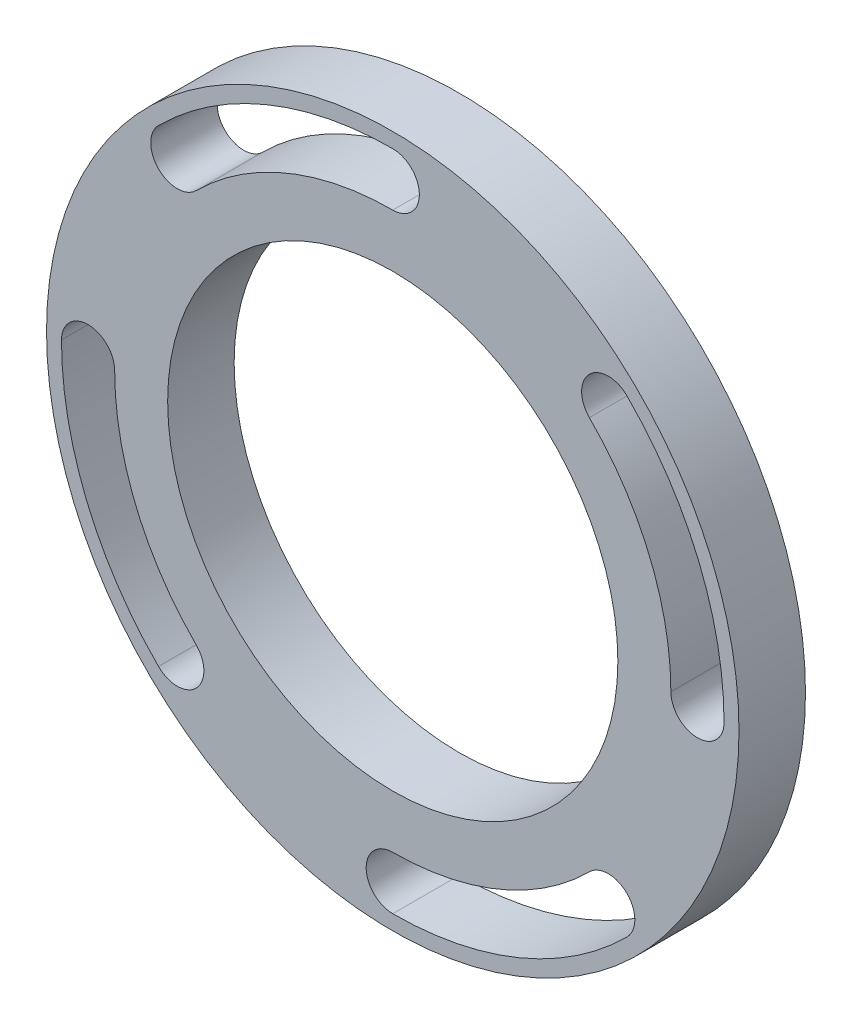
ISO-10303-21;
HEADER;
FILE_DESCRIPTION(('STEP AP214'),'2;1');
FILE_NAME('part.step','',(''),(''),'','','');
FILE_SCHEMA(('AUTOMOTIVE_DESIGN { 1 0 10303 214 1 1 1 1 }'));
ENDSEC;
DATA;
#1=APPLICATION_CONTEXT('core data for automotive mechanical design processes');
#2=APPLICATION_PROTOCOL_DEFINITION('international standard','automotive_design',2000,#1);
#3=PRODUCT_CONTEXT('',#1,'mechanical');
#4=PRODUCT('Part','Part','',(#3));
#5=PRODUCT_RELATED_PRODUCT_CATEGORY('part','',(#4));
#6=PRODUCT_DEFINITION_FORMATION('','',#4);
#7=PRODUCT_DEFINITION_CONTEXT('part definition',#1,'design');
#8=PRODUCT_DEFINITION('design','',#6,#7);
#9=PRODUCT_DEFINITION_SHAPE('','',#8);
#10=(LENGTH_UNIT() NAMED_UNIT(*) SI_UNIT(.MILLI.,.METRE.));
#11=(NAMED_UNIT(*) PLANE_ANGLE_UNIT() SI_UNIT($,.RADIAN.));
#12=(NAMED_UNIT(*) SI_UNIT($,.STERADIAN.) SOLID_ANGLE_UNIT());
#13=UNCERTAINTY_MEASURE_WITH_UNIT(LENGTH_MEASURE(1.E-05),#10,'distance_accuracy_value','');
#14=(GEOMETRIC_REPRESENTATION_CONTEXT(3) GLOBAL_UNCERTAINTY_ASSIGNED_CONTEXT((#13)) GLOBAL_UNIT_ASSIGNED_CONTEXT((#10,
#11,#12)) REPRESENTATION_CONTEXT('',''));
#15=CARTESIAN_POINT('',(0.,0.,0.));
#16=DIRECTION('',(0.,0.,1.));
#17=DIRECTION('',(1.,0.,0.));
#18=AXIS2_PLACEMENT_3D('',#15,#16,#17);
#19=CARTESIAN_POINT('',(0.,0.,-0.508000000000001));
#20=DIRECTION('',(0.,0.,-1.));
#21=DIRECTION('',(-1.,0.,0.));
#22=AXIS2_PLACEMENT_3D('',#19,#20,#21);
#23=PLANE('',#22);
#24=CARTESIAN_POINT('',(0.,0.,-0.508000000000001));
#25=DIRECTION('',(0.,0.,1.));
#26=DIRECTION('',(0.,1.,0.));
#27=AXIS2_PLACEMENT_3D('',#24,#25,#26);
#28=CIRCLE('',#27,19.1262);
#29=CARTESIAN_POINT('',(19.1262,1.97407768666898E-13,-0.508000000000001));
#30=VERTEX_POINT('',#29);
#31=CARTESIAN_POINT('',(13.5242657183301,13.5242657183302,-0.508000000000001));
#32=VERTEX_POINT('',#31);
#33=EDGE_CURVE('E156',#30,#32,#28,.T.);
#34=ORIENTED_EDGE('',*,*,#33,.T.);
#35=CARTESIAN_POINT('',(14.817422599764,14.8174225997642,-0.508000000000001));
#36=DIRECTION('',(0.,0.,-1.));
#37=DIRECTION('',(0.,1.,0.));
#38=AXIS2_PLACEMENT_3D('',#35,#36,#37);
#39=CIRCLE('',#38,1.8288);
#40=CARTESIAN_POINT('',(16.110579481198,16.1105794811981,-0.508000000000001));
#41=VERTEX_POINT('',#40);
#42=EDGE_CURVE('E150',#32,#41,#39,.T.);
#43=ORIENTED_EDGE('',*,*,#42,.T.);
#44=CARTESIAN_POINT('',(0.,0.,-0.508000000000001));
#45=DIRECTION('',(0.,0.,-1.));
#46=DIRECTION('',(0.,1.,0.));
#47=AXIS2_PLACEMENT_3D('',#44,#45,#46);
#48=CIRCLE('',#47,22.7838);
#49=CARTESIAN_POINT('',(22.7838,2.34983723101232E-13,-0.508000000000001));
#50=VERTEX_POINT('',#49);
#51=EDGE_CURVE('E159',#41,#50,#48,.T.);
#52=ORIENTED_EDGE('',*,*,#51,.T.);
#53=CARTESIAN_POINT('',(20.955,2.16899376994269E-13,-0.508000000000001));
#54=DIRECTION('',(0.,0.,-1.));
#55=DIRECTION('',(0.,1.,0.));
#56=AXIS2_PLACEMENT_3D('',#53,#54,#55);
#57=CIRCLE('',#56,1.8288);
#58=EDGE_CURVE('E50',#50,#30,#57,.T.);
#59=ORIENTED_EDGE('',*,*,#58,.T.);
#60=EDGE_LOOP('',(#34,#43,#52,#59));
#61=FACE_BOUND('',#60,.T.);
#62=CARTESIAN_POINT('',(0.,0.,-0.508000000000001));
#63=DIRECTION('',(0.,0.,1.));
#64=DIRECTION('',(1.,0.,0.));
#65=AXIS2_PLACEMENT_3D('',#62,#63,#64);
#66=CIRCLE('',#65,19.1262);
#67=CARTESIAN_POINT('',(0.,-19.1262,-0.508000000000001));
#68=VERTEX_POINT('',#67);
#69=CARTESIAN_POINT('',(13.5242657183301,-13.5242657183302,-0.508000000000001));
#70=VERTEX_POINT('',#69);
#71=EDGE_CURVE('E194',#68,#70,#66,.T.);
#72=ORIENTED_EDGE('',*,*,#71,.T.);
#73=CARTESIAN_POINT('',(14.817422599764,-14.8174225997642,-0.508000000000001));
#74=DIRECTION('',(0.,0.,-1.));
#75=DIRECTION('',(1.,0.,0.));
#76=AXIS2_PLACEMENT_3D('',#73,#74,#75);
#77=CIRCLE('',#76,1.8288);
#78=CARTESIAN_POINT('',(16.110579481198,-16.1105794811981,-0.508000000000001));
#79=VERTEX_POINT('',#78);
#80=EDGE_CURVE('E184',#70,#79,#77,.T.);
#81=ORIENTED_EDGE('',*,*,#80,.T.);
#82=CARTESIAN_POINT('',(0.,0.,-0.508000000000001));
#83=DIRECTION('',(0.,0.,-1.));
#84=DIRECTION('',(1.,0.,0.));
#85=AXIS2_PLACEMENT_3D('',#82,#83,#84);
#86=CIRCLE('',#85,22.7838);
#87=CARTESIAN_POINT('',(0.,-22.7838,-0.508000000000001));
#88=VERTEX_POINT('',#87);
#89=EDGE_CURVE('E187',#79,#88,#86,.T.);
#90=ORIENTED_EDGE('',*,*,#89,.T.);
#91=CARTESIAN_POINT('',(0.,-20.955,-0.508000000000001));
#92=DIRECTION('',(0.,0.,-1.));
#93=DIRECTION('',(1.,0.,0.));
#94=AXIS2_PLACEMENT_3D('',#91,#92,#93);
#95=CIRCLE('',#94,1.8288);
#96=EDGE_CURVE('E191',#88,#68,#95,.T.);
#97=ORIENTED_EDGE('',*,*,#96,.T.);
#98=EDGE_LOOP('',(#72,#81,#90,#97));
#99=FACE_BOUND('',#98,.T.);
#100=CARTESIAN_POINT('',(0.,0.,-0.508000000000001));
#101=DIRECTION('',(0.,0.,1.));
#102=DIRECTION('',(0.,-1.,0.));
#103=AXIS2_PLACEMENT_3D('',#100,#101,#102);
#104=CIRCLE('',#103,19.1262);
#105=CARTESIAN_POINT('',(-19.1262,0.,-0.508000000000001));
#106=VERTEX_POINT('',#105);
#107=CARTESIAN_POINT('',(-13.5242657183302,-13.5242657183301,-0.508000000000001));
#108=VERTEX_POINT('',#107);
#109=EDGE_CURVE('E226',#106,#108,#104,.T.);
#110=ORIENTED_EDGE('',*,*,#109,.T.);
#111=CARTESIAN_POINT('',(-14.8174225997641,-14.8174225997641,-0.508000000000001));
#112=DIRECTION('',(0.,0.,-1.));
#113=DIRECTION('',(0.,-1.,0.));
#114=AXIS2_PLACEMENT_3D('',#111,#112,#113);
#115=CIRCLE('',#114,1.8288);
#116=CARTESIAN_POINT('',(-16.1105794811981,-16.110579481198,-0.508000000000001));
#117=VERTEX_POINT('',#116);
#118=EDGE_CURVE('E216',#108,#117,#115,.T.);
#119=ORIENTED_EDGE('',*,*,#118,.T.);
#120=CARTESIAN_POINT('',(0.,0.,-0.508000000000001));
#121=DIRECTION('',(0.,0.,-1.));
#122=DIRECTION('',(0.,-1.,0.));
#123=AXIS2_PLACEMENT_3D('',#120,#121,#122);
#124=CIRCLE('',#123,22.7838);
#125=CARTESIAN_POINT('',(-22.7838,0.,-0.508000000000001));
#126=VERTEX_POINT('',#125);
#127=EDGE_CURVE('E219',#117,#126,#124,.T.);
#128=ORIENTED_EDGE('',*,*,#127,.T.);
#129=CARTESIAN_POINT('',(-20.955,0.,-0.508000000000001));
#130=DIRECTION('',(0.,0.,-1.));
#131=DIRECTION('',(0.,-1.,0.));
#132=AXIS2_PLACEMENT_3D('',#129,#130,#131);
#133=CIRCLE('',#132,1.8288);
#134=EDGE_CURVE('E223',#126,#106,#133,.T.);
#135=ORIENTED_EDGE('',*,*,#134,.T.);
#136=EDGE_LOOP('',(#110,#119,#128,#135));
#137=FACE_BOUND('',#136,.T.);
#138=CARTESIAN_POINT('',(0.,0.,-0.508000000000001));
#139=DIRECTION('',(0.,0.,1.));
#140=DIRECTION('',(-1.,0.,0.));
#141=AXIS2_PLACEMENT_3D('',#138,#139,#140);
#142=CIRCLE('',#141,19.1262);
#143=CARTESIAN_POINT('',(0.,19.1262,-0.508000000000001));
#144=VERTEX_POINT('',#143);
#145=CARTESIAN_POINT('',(-13.5242657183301,13.5242657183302,-0.508000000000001));
#146=VERTEX_POINT('',#145);
#147=EDGE_CURVE('E258',#144,#146,#142,.T.);
#148=ORIENTED_EDGE('',*,*,#147,.T.);
#149=CARTESIAN_POINT('',(-14.817422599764,14.8174225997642,-0.508000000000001));
#150=DIRECTION('',(0.,0.,-1.));
#151=DIRECTION('',(-1.,0.,0.));
#152=AXIS2_PLACEMENT_3D('',#149,#150,#151);
#153=CIRCLE('',#152,1.8288);
#154=CARTESIAN_POINT('',(-16.110579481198,16.1105794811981,-0.508000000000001));
#155=VERTEX_POINT('',#154);
#156=EDGE_CURVE('E248',#146,#155,#153,.T.);
#157=ORIENTED_EDGE('',*,*,#156,.T.);
#158=CARTESIAN_POINT('',(0.,0.,-0.508000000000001));
#159=DIRECTION('',(0.,0.,-1.));
#160=DIRECTION('',(-1.,0.,0.));
#161=AXIS2_PLACEMENT_3D('',#158,#159,#160);
#162=CIRCLE('',#161,22.7838);
#163=CARTESIAN_POINT('',(0.,22.7838,-0.508000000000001));
#164=VERTEX_POINT('',#163);
#165=EDGE_CURVE('E251',#155,#164,#162,.T.);
#166=ORIENTED_EDGE('',*,*,#165,.T.);
#167=CARTESIAN_POINT('',(0.,20.955,-0.508000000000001));
#168=DIRECTION('',(0.,0.,-1.));
#169=DIRECTION('',(-1.,0.,0.));
#170=AXIS2_PLACEMENT_3D('',#167,#168,#169);
#171=CIRCLE('',#170,1.8288);
#172=EDGE_CURVE('E255',#164,#144,#171,.T.);
#173=ORIENTED_EDGE('',*,*,#172,.T.);
#174=EDGE_LOOP('',(#148,#157,#166,#173));
#175=FACE_BOUND('',#174,.T.);
#176=CARTESIAN_POINT('',(0.,0.,-0.508000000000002));
#177=DIRECTION('',(0.,0.,1.));
#178=DIRECTION('',(1.,0.,0.));
#179=AXIS2_PLACEMENT_3D('',#176,#177,#178);
#180=CIRCLE('',#179,15.4813);
#181=CARTESIAN_POINT('',(15.4813,0.,-0.508000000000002));
#182=VERTEX_POINT('',#181);
#183=EDGE_CURVE('E11',#182,#182,#180,.T.);
#184=ORIENTED_EDGE('',*,*,#183,.F.);
#185=EDGE_LOOP('',(#184));
#186=FACE_BOUND('',#185,.T.);
#187=CARTESIAN_POINT('',(0.,0.,-0.508000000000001));
#188=DIRECTION('',(0.,0.,1.));
#189=DIRECTION('',(1.,0.,0.));
#190=AXIS2_PLACEMENT_3D('',#187,#188,#189);
#191=CIRCLE('',#190,23.8125);
#192=CARTESIAN_POINT('',(23.8125,0.,-0.508000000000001));
#193=VERTEX_POINT('',#192);
#194=EDGE_CURVE('E273',#193,#193,#191,.T.);
#195=ORIENTED_EDGE('',*,*,#194,.T.);
#196=EDGE_LOOP('',(#195));
#197=FACE_BOUND('',#196,.T.);
#198=ADVANCED_FACE('F36',(#61,#99,#137,#175,#186,#197),#23,.F.);
#199=CARTESIAN_POINT('',(0.,0.,5.03230046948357));
#200=DIRECTION('',(0.,0.,1.));
#201=DIRECTION('',(1.,0.,0.));
#202=AXIS2_PLACEMENT_3D('',#199,#200,#201);
#203=CYLINDRICAL_SURFACE('',#202,15.4813);
#204=CARTESIAN_POINT('',(0.,0.,-5.08));
#205=DIRECTION('',(0.,0.,1.));
#206=DIRECTION('',(1.,0.,0.));
#207=AXIS2_PLACEMENT_3D('',#204,#205,#206);
#208=CIRCLE('',#207,15.4813);
#209=CARTESIAN_POINT('',(15.4813,0.,-5.08));
#210=VERTEX_POINT('',#209);
#211=EDGE_CURVE('E43',#210,#210,#208,.T.);
#212=ORIENTED_EDGE('',*,*,#211,.F.);
#213=EDGE_LOOP('',(#212));
#214=FACE_BOUND('',#213,.T.);
#215=ORIENTED_EDGE('',*,*,#183,.T.);
#216=EDGE_LOOP('',(#215));
#217=FACE_BOUND('',#216,.T.);
#218=ADVANCED_FACE('F289',(#214,#217),#203,.F.);
#219=CARTESIAN_POINT('',(0.,0.,-5.08));
#220=DIRECTION('',(0.,0.,1.));
#221=DIRECTION('',(1.,0.,0.));
#222=AXIS2_PLACEMENT_3D('',#219,#220,#221);
#223=PLANE('',#222);
#224=CARTESIAN_POINT('',(0.,0.,-5.08));
#225=DIRECTION('',(0.,0.,-1.));
#226=DIRECTION('',(0.,1.,0.));
#227=AXIS2_PLACEMENT_3D('',#224,#225,#226);
#228=CIRCLE('',#227,22.7838);
#229=CARTESIAN_POINT('',(16.110579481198,16.1105794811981,-5.08));
#230=VERTEX_POINT('',#229);
#231=CARTESIAN_POINT('',(22.7838,2.34983723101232E-13,-5.08));
#232=VERTEX_POINT('',#231);
#233=EDGE_CURVE('E174',#230,#232,#228,.T.);
#234=ORIENTED_EDGE('',*,*,#233,.F.);
#235=CARTESIAN_POINT('',(14.817422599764,14.8174225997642,-5.08));
#236=DIRECTION('',(0.,0.,-1.));
#237=DIRECTION('',(0.,1.,0.));
#238=AXIS2_PLACEMENT_3D('',#235,#236,#237);
#239=CIRCLE('',#238,1.8288);
#240=CARTESIAN_POINT('',(13.5242657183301,13.5242657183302,-5.08));
#241=VERTEX_POINT('',#240);
#242=EDGE_CURVE('E58',#241,#230,#239,.T.);
#243=ORIENTED_EDGE('',*,*,#242,.F.);
#244=CARTESIAN_POINT('',(0.,0.,-5.08));
#245=DIRECTION('',(0.,0.,1.));
#246=DIRECTION('',(0.,1.,0.));
#247=AXIS2_PLACEMENT_3D('',#244,#245,#246);
#248=CIRCLE('',#247,19.1262);
#249=CARTESIAN_POINT('',(19.1262,1.97407768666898E-13,-5.08));
#250=VERTEX_POINT('',#249);
#251=EDGE_CURVE('E165',#250,#241,#248,.T.);
#252=ORIENTED_EDGE('',*,*,#251,.F.);
#253=CARTESIAN_POINT('',(20.955,2.16899376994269E-13,-5.08));
#254=DIRECTION('',(0.,0.,-1.));
#255=DIRECTION('',(0.,1.,0.));
#256=AXIS2_PLACEMENT_3D('',#253,#254,#255);
#257=CIRCLE('',#256,1.8288);
#258=EDGE_CURVE('E168',#232,#250,#257,.T.);
#259=ORIENTED_EDGE('',*,*,#258,.F.);
#260=EDGE_LOOP('',(#234,#243,#252,#259));
#261=FACE_BOUND('',#260,.T.);
#262=CARTESIAN_POINT('',(0.,0.,-5.08));
#263=DIRECTION('',(0.,0.,-1.));
#264=DIRECTION('',(1.,0.,0.));
#265=AXIS2_PLACEMENT_3D('',#262,#263,#264);
#266=CIRCLE('',#265,22.7838);
#267=CARTESIAN_POINT('',(16.110579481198,-16.1105794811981,-5.08));
#268=VERTEX_POINT('',#267);
#269=CARTESIAN_POINT('',(0.,-22.7838,-5.08));
#270=VERTEX_POINT('',#269);
#271=EDGE_CURVE('E199',#268,#270,#266,.T.);
#272=ORIENTED_EDGE('',*,*,#271,.F.);
#273=CARTESIAN_POINT('',(14.817422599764,-14.8174225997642,-5.08));
#274=DIRECTION('',(0.,0.,-1.));
#275=DIRECTION('',(1.,0.,0.));
#276=AXIS2_PLACEMENT_3D('',#273,#274,#275);
#277=CIRCLE('',#276,1.8288);
#278=CARTESIAN_POINT('',(13.5242657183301,-13.5242657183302,-5.08));
#279=VERTEX_POINT('',#278);
#280=EDGE_CURVE('E180',#279,#268,#277,.T.);
#281=ORIENTED_EDGE('',*,*,#280,.F.);
#282=CARTESIAN_POINT('',(0.,0.,-5.08));
#283=DIRECTION('',(0.,0.,1.));
#284=DIRECTION('',(1.,0.,0.));
#285=AXIS2_PLACEMENT_3D('',#282,#283,#284);
#286=CIRCLE('',#285,19.1262);
#287=CARTESIAN_POINT('',(0.,-19.1262,-5.08));
#288=VERTEX_POINT('',#287);
#289=EDGE_CURVE('E188',#288,#279,#286,.T.);
#290=ORIENTED_EDGE('',*,*,#289,.F.);
#291=CARTESIAN_POINT('',(0.,-20.955,-5.08));
#292=DIRECTION('',(0.,0.,-1.));
#293=DIRECTION('',(1.,0.,0.));
#294=AXIS2_PLACEMENT_3D('',#291,#292,#293);
#295=CIRCLE('',#294,1.8288);
#296=EDGE_CURVE('E202',#270,#288,#295,.T.);
#297=ORIENTED_EDGE('',*,*,#296,.F.);
#298=EDGE_LOOP('',(#272,#281,#290,#297));
#299=FACE_BOUND('',#298,.T.);
#300=CARTESIAN_POINT('',(0.,0.,-5.08));
#301=DIRECTION('',(0.,0.,-1.));
#302=DIRECTION('',(0.,-1.,0.));
#303=AXIS2_PLACEMENT_3D('',#300,#301,#302);
#304=CIRCLE('',#303,22.7838);
#305=CARTESIAN_POINT('',(-16.1105794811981,-16.110579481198,-5.08));
#306=VERTEX_POINT('',#305);
#307=CARTESIAN_POINT('',(-22.7838,0.,-5.08));
#308=VERTEX_POINT('',#307);
#309=EDGE_CURVE('E231',#306,#308,#304,.T.);
#310=ORIENTED_EDGE('',*,*,#309,.F.);
#311=CARTESIAN_POINT('',(-14.8174225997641,-14.8174225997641,-5.08));
#312=DIRECTION('',(0.,0.,-1.));
#313=DIRECTION('',(0.,-1.,0.));
#314=AXIS2_PLACEMENT_3D('',#311,#312,#313);
#315=CIRCLE('',#314,1.8288);
#316=CARTESIAN_POINT('',(-13.5242657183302,-13.5242657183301,-5.08));
#317=VERTEX_POINT('',#316);
#318=EDGE_CURVE('E209',#317,#306,#315,.T.);
#319=ORIENTED_EDGE('',*,*,#318,.F.);
#320=CARTESIAN_POINT('',(0.,0.,-5.08));
#321=DIRECTION('',(0.,0.,1.));
#322=DIRECTION('',(0.,-1.,0.));
#323=AXIS2_PLACEMENT_3D('',#320,#321,#322);
#324=CIRCLE('',#323,19.1262);
#325=CARTESIAN_POINT('',(-19.1262,0.,-5.08));
#326=VERTEX_POINT('',#325);
#327=EDGE_CURVE('E220',#326,#317,#324,.T.);
#328=ORIENTED_EDGE('',*,*,#327,.F.);
#329=CARTESIAN_POINT('',(-20.955,0.,-5.08));
#330=DIRECTION('',(0.,0.,-1.));
#331=DIRECTION('',(0.,-1.,0.));
#332=AXIS2_PLACEMENT_3D('',#329,#330,#331);
#333=CIRCLE('',#332,1.8288);
#334=EDGE_CURVE('E234',#308,#326,#333,.T.);
#335=ORIENTED_EDGE('',*,*,#334,.F.);
#336=EDGE_LOOP('',(#310,#319,#328,#335));
#337=FACE_BOUND('',#336,.T.);
#338=CARTESIAN_POINT('',(0.,0.,-5.08));
#339=DIRECTION('',(0.,0.,-1.));
#340=DIRECTION('',(-1.,0.,0.));
#341=AXIS2_PLACEMENT_3D('',#338,#339,#340);
#342=CIRCLE('',#341,22.7838);
#343=CARTESIAN_POINT('',(-16.110579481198,16.1105794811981,-5.08));
#344=VERTEX_POINT('',#343);
#345=CARTESIAN_POINT('',(0.,22.7838,-5.08));
#346=VERTEX_POINT('',#345);
#347=EDGE_CURVE('E263',#344,#346,#342,.T.);
#348=ORIENTED_EDGE('',*,*,#347,.F.);
#349=CARTESIAN_POINT('',(-14.817422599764,14.8174225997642,-5.08));
#350=DIRECTION('',(0.,0.,-1.));
#351=DIRECTION('',(-1.,0.,0.));
#352=AXIS2_PLACEMENT_3D('',#349,#350,#351);
#353=CIRCLE('',#352,1.8288);
#354=CARTESIAN_POINT('',(-13.5242657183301,13.5242657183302,-5.08));
#355=VERTEX_POINT('',#354);
#356=EDGE_CURVE('E241',#355,#344,#353,.T.);
#357=ORIENTED_EDGE('',*,*,#356,.F.);
#358=CARTESIAN_POINT('',(0.,0.,-5.08));
#359=DIRECTION('',(0.,0.,1.));
#360=DIRECTION('',(-1.,0.,0.));
#361=AXIS2_PLACEMENT_3D('',#358,#359,#360);
#362=CIRCLE('',#361,19.1262);
#363=CARTESIAN_POINT('',(0.,19.1262,-5.08));
#364=VERTEX_POINT('',#363);
#365=EDGE_CURVE('E252',#364,#355,#362,.T.);
#366=ORIENTED_EDGE('',*,*,#365,.F.);
#367=CARTESIAN_POINT('',(0.,20.955,-5.08));
#368=DIRECTION('',(0.,0.,-1.));
#369=DIRECTION('',(-1.,0.,0.));
#370=AXIS2_PLACEMENT_3D('',#367,#368,#369);
#371=CIRCLE('',#370,1.8288);
#372=EDGE_CURVE('E266',#346,#364,#371,.T.);
#373=ORIENTED_EDGE('',*,*,#372,.F.);
#374=EDGE_LOOP('',(#348,#357,#366,#373));
#375=FACE_BOUND('',#374,.T.);
#376=CARTESIAN_POINT('',(0.,0.,-5.08));
#377=DIRECTION('',(0.,0.,1.));
#378=DIRECTION('',(1.,0.,0.));
#379=AXIS2_PLACEMENT_3D('',#376,#377,#378);
#380=CIRCLE('',#379,23.8125);
#381=CARTESIAN_POINT('',(23.8125,0.,-5.08));
#382=VERTEX_POINT('',#381);
#383=EDGE_CURVE('E282',#382,#382,#380,.T.);
#384=ORIENTED_EDGE('',*,*,#383,.F.);
#385=EDGE_LOOP('',(#384));
#386=FACE_BOUND('',#385,.T.);
#387=ORIENTED_EDGE('',*,*,#211,.T.);
#388=EDGE_LOOP('',(#387));
#389=FACE_BOUND('',#388,.T.);
#390=ADVANCED_FACE('F287',(#261,#299,#337,#375,#386,#389),#223,.F.);
#391=CARTESIAN_POINT('',(0.,0.,5.03230046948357));
#392=DIRECTION('',(0.,0.,1.));
#393=DIRECTION('',(1.,0.,0.));
#394=AXIS2_PLACEMENT_3D('',#391,#392,#393);
#395=CYLINDRICAL_SURFACE('',#394,23.8125);
#396=ORIENTED_EDGE('',*,*,#194,.F.);
#397=EDGE_LOOP('',(#396));
#398=FACE_BOUND('',#397,.T.);
#399=ORIENTED_EDGE('',*,*,#383,.T.);
#400=EDGE_LOOP('',(#399));
#401=FACE_BOUND('',#400,.T.);
#402=ADVANCED_FACE('F298',(#398,#401),#395,.T.);
#403=CARTESIAN_POINT('',(-14.817422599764,14.8174225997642,-0.508000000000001));
#404=DIRECTION('',(0.,0.,-1.));
#405=DIRECTION('',(-1.,0.,0.));
#406=AXIS2_PLACEMENT_3D('',#403,#404,#405);
#407=CYLINDRICAL_SURFACE('',#406,1.8288);
#408=ORIENTED_EDGE('',*,*,#356,.T.);
#409=DIRECTION('',(0.,0.,-1.));
#410=VECTOR('',#409,1.);
#411=CARTESIAN_POINT('',(-16.110579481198,16.1105794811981,-0.508000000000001));
#412=LINE('',#411,#410);
#413=EDGE_CURVE('E261',#155,#344,#412,.T.);
#414=ORIENTED_EDGE('',*,*,#413,.F.);
#415=ORIENTED_EDGE('',*,*,#156,.F.);
#416=DIRECTION('',(0.,0.,-1.));
#417=VECTOR('',#416,1.);
#418=CARTESIAN_POINT('',(-13.5242657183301,13.5242657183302,-0.508000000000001));
#419=LINE('',#418,#417);
#420=EDGE_CURVE('E271',#146,#355,#419,.T.);
#421=ORIENTED_EDGE('',*,*,#420,.T.);
#422=EDGE_LOOP('',(#408,#414,#415,#421));
#423=FACE_BOUND('',#422,.T.);
#424=ADVANCED_FACE('F301',(#423),#407,.F.);
#425=CARTESIAN_POINT('',(0.,0.,-0.508000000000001));
#426=DIRECTION('',(0.,0.,-1.));
#427=DIRECTION('',(-1.,0.,0.));
#428=AXIS2_PLACEMENT_3D('',#425,#426,#427);
#429=CYLINDRICAL_SURFACE('',#428,19.1262);
#430=ORIENTED_EDGE('',*,*,#365,.T.);
#431=ORIENTED_EDGE('',*,*,#420,.F.);
#432=ORIENTED_EDGE('',*,*,#147,.F.);
#433=DIRECTION('',(0.,0.,-1.));
#434=VECTOR('',#433,1.);
#435=CARTESIAN_POINT('',(0.,19.1262,-0.508000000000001));
#436=LINE('',#435,#434);
#437=EDGE_CURVE('E274',#144,#364,#436,.T.);
#438=ORIENTED_EDGE('',*,*,#437,.T.);
#439=EDGE_LOOP('',(#430,#431,#432,#438));
#440=FACE_BOUND('',#439,.T.);
#441=ADVANCED_FACE('F314',(#440),#429,.T.);
#442=CARTESIAN_POINT('',(0.,20.955,-0.508000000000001));
#443=DIRECTION('',(0.,0.,-1.));
#444=DIRECTION('',(-1.,0.,0.));
#445=AXIS2_PLACEMENT_3D('',#442,#443,#444);
#446=CYLINDRICAL_SURFACE('',#445,1.8288);
#447=ORIENTED_EDGE('',*,*,#372,.T.);
#448=ORIENTED_EDGE('',*,*,#437,.F.);
#449=ORIENTED_EDGE('',*,*,#172,.F.);
#450=DIRECTION('',(0.,0.,-1.));
#451=VECTOR('',#450,1.);
#452=CARTESIAN_POINT('',(0.,22.7838,-0.508000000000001));
#453=LINE('',#452,#451);
#454=EDGE_CURVE('E276',#164,#346,#453,.T.);
#455=ORIENTED_EDGE('',*,*,#454,.T.);
#456=EDGE_LOOP('',(#447,#448,#449,#455));
#457=FACE_BOUND('',#456,.T.);
#458=ADVANCED_FACE('F320',(#457),#446,.F.);
#459=CARTESIAN_POINT('',(0.,0.,-0.508000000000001));
#460=DIRECTION('',(0.,0.,-1.));
#461=DIRECTION('',(-1.,0.,0.));
#462=AXIS2_PLACEMENT_3D('',#459,#460,#461);
#463=CYLINDRICAL_SURFACE('',#462,22.7838);
#464=ORIENTED_EDGE('',*,*,#347,.T.);
#465=ORIENTED_EDGE('',*,*,#454,.F.);
#466=ORIENTED_EDGE('',*,*,#165,.F.);
#467=ORIENTED_EDGE('',*,*,#413,.T.);
#468=EDGE_LOOP('',(#464,#465,#466,#467));
#469=FACE_BOUND('',#468,.T.);
#470=ADVANCED_FACE('F316',(#469),#463,.F.);
#471=CARTESIAN_POINT('',(-14.8174225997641,-14.8174225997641,-0.508000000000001));
#472=DIRECTION('',(0.,0.,-1.));
#473=DIRECTION('',(-1.,0.,0.));
#474=AXIS2_PLACEMENT_3D('',#471,#472,#473);
#475=CYLINDRICAL_SURFACE('',#474,1.8288);
#476=ORIENTED_EDGE('',*,*,#318,.T.);
#477=DIRECTION('',(0.,0.,-1.));
#478=VECTOR('',#477,1.);
#479=CARTESIAN_POINT('',(-16.1105794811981,-16.110579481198,-0.508000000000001));
#480=LINE('',#479,#478);
#481=EDGE_CURVE('E229',#117,#306,#480,.T.);
#482=ORIENTED_EDGE('',*,*,#481,.F.);
#483=ORIENTED_EDGE('',*,*,#118,.F.);
#484=DIRECTION('',(0.,0.,-1.));
#485=VECTOR('',#484,1.);
#486=CARTESIAN_POINT('',(-13.5242657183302,-13.5242657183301,-0.508000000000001));
#487=LINE('',#486,#485);
#488=EDGE_CURVE('E239',#108,#317,#487,.T.);
#489=ORIENTED_EDGE('',*,*,#488,.T.);
#490=EDGE_LOOP('',(#476,#482,#483,#489));
#491=FACE_BOUND('',#490,.T.);
#492=ADVANCED_FACE('F319',(#491),#475,.F.);
#493=CARTESIAN_POINT('',(0.,0.,-0.508000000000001));
#494=DIRECTION('',(0.,0.,-1.));
#495=DIRECTION('',(-1.,0.,0.));
#496=AXIS2_PLACEMENT_3D('',#493,#494,#495);
#497=CYLINDRICAL_SURFACE('',#496,19.1262);
#498=ORIENTED_EDGE('',*,*,#327,.T.);
#499=ORIENTED_EDGE('',*,*,#488,.F.);
#500=ORIENTED_EDGE('',*,*,#109,.F.);
#501=DIRECTION('',(0.,0.,-1.));
#502=VECTOR('',#501,1.);
#503=CARTESIAN_POINT('',(-19.1262,0.,-0.508000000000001));
#504=LINE('',#503,#502);
#505=EDGE_CURVE('E242',#106,#326,#504,.T.);
#506=ORIENTED_EDGE('',*,*,#505,.T.);
#507=EDGE_LOOP('',(#498,#499,#500,#506));
#508=FACE_BOUND('',#507,.T.);
#509=ADVANCED_FACE('F330',(#508),#497,.T.);
#510=CARTESIAN_POINT('',(-20.955,0.,-0.508000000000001));
#511=DIRECTION('',(0.,0.,-1.));
#512=DIRECTION('',(-1.,0.,0.));
#513=AXIS2_PLACEMENT_3D('',#510,#511,#512);
#514=CYLINDRICAL_SURFACE('',#513,1.8288);
#515=ORIENTED_EDGE('',*,*,#334,.T.);
#516=ORIENTED_EDGE('',*,*,#505,.F.);
#517=ORIENTED_EDGE('',*,*,#134,.F.);
#518=DIRECTION('',(0.,0.,-1.));
#519=VECTOR('',#518,1.);
#520=CARTESIAN_POINT('',(-22.7838,0.,-0.508000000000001));
#521=LINE('',#520,#519);
#522=EDGE_CURVE('E244',#126,#308,#521,.T.);
#523=ORIENTED_EDGE('',*,*,#522,.T.);
#524=EDGE_LOOP('',(#515,#516,#517,#523));
#525=FACE_BOUND('',#524,.T.);
#526=ADVANCED_FACE('F336',(#525),#514,.F.);
#527=CARTESIAN_POINT('',(0.,0.,-0.508000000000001));
#528=DIRECTION('',(0.,0.,-1.));
#529=DIRECTION('',(-1.,0.,0.));
#530=AXIS2_PLACEMENT_3D('',#527,#528,#529);
#531=CYLINDRICAL_SURFACE('',#530,22.7838);
#532=ORIENTED_EDGE('',*,*,#309,.T.);
#533=ORIENTED_EDGE('',*,*,#522,.F.);
#534=ORIENTED_EDGE('',*,*,#127,.F.);
#535=ORIENTED_EDGE('',*,*,#481,.T.);
#536=EDGE_LOOP('',(#532,#533,#534,#535));
#537=FACE_BOUND('',#536,.T.);
#538=ADVANCED_FACE('F332',(#537),#531,.F.);
#539=CARTESIAN_POINT('',(14.817422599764,-14.8174225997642,-0.508000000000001));
#540=DIRECTION('',(0.,0.,-1.));
#541=DIRECTION('',(-1.,0.,0.));
#542=AXIS2_PLACEMENT_3D('',#539,#540,#541);
#543=CYLINDRICAL_SURFACE('',#542,1.8288);
#544=ORIENTED_EDGE('',*,*,#280,.T.);
#545=DIRECTION('',(0.,0.,-1.));
#546=VECTOR('',#545,1.);
#547=CARTESIAN_POINT('',(16.110579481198,-16.1105794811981,-0.508000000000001));
#548=LINE('',#547,#546);
#549=EDGE_CURVE('E197',#79,#268,#548,.T.);
#550=ORIENTED_EDGE('',*,*,#549,.F.);
#551=ORIENTED_EDGE('',*,*,#80,.F.);
#552=DIRECTION('',(0.,0.,-1.));
#553=VECTOR('',#552,1.);
#554=CARTESIAN_POINT('',(13.5242657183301,-13.5242657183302,-0.508000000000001));
#555=LINE('',#554,#553);
#556=EDGE_CURVE('E207',#70,#279,#555,.T.);
#557=ORIENTED_EDGE('',*,*,#556,.T.);
#558=EDGE_LOOP('',(#544,#550,#551,#557));
#559=FACE_BOUND('',#558,.T.);
#560=ADVANCED_FACE('F335',(#559),#543,.F.);
#561=CARTESIAN_POINT('',(0.,0.,-0.508000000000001));
#562=DIRECTION('',(0.,0.,-1.));
#563=DIRECTION('',(-1.,0.,0.));
#564=AXIS2_PLACEMENT_3D('',#561,#562,#563);
#565=CYLINDRICAL_SURFACE('',#564,19.1262);
#566=ORIENTED_EDGE('',*,*,#289,.T.);
#567=ORIENTED_EDGE('',*,*,#556,.F.);
#568=ORIENTED_EDGE('',*,*,#71,.F.);
#569=DIRECTION('',(0.,0.,-1.));
#570=VECTOR('',#569,1.);
#571=CARTESIAN_POINT('',(0.,-19.1262,-0.508000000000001));
#572=LINE('',#571,#570);
#573=EDGE_CURVE('E210',#68,#288,#572,.T.);
#574=ORIENTED_EDGE('',*,*,#573,.T.);
#575=EDGE_LOOP('',(#566,#567,#568,#574));
#576=FACE_BOUND('',#575,.T.);
#577=ADVANCED_FACE('F346',(#576),#565,.T.);
#578=CARTESIAN_POINT('',(0.,-20.955,-0.508000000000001));
#579=DIRECTION('',(0.,0.,-1.));
#580=DIRECTION('',(-1.,0.,0.));
#581=AXIS2_PLACEMENT_3D('',#578,#579,#580);
#582=CYLINDRICAL_SURFACE('',#581,1.8288);
#583=ORIENTED_EDGE('',*,*,#296,.T.);
#584=ORIENTED_EDGE('',*,*,#573,.F.);
#585=ORIENTED_EDGE('',*,*,#96,.F.);
#586=DIRECTION('',(0.,0.,-1.));
#587=VECTOR('',#586,1.);
#588=CARTESIAN_POINT('',(0.,-22.7838,-0.508000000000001));
#589=LINE('',#588,#587);
#590=EDGE_CURVE('E212',#88,#270,#589,.T.);
#591=ORIENTED_EDGE('',*,*,#590,.T.);
#592=EDGE_LOOP('',(#583,#584,#585,#591));
#593=FACE_BOUND('',#592,.T.);
#594=ADVANCED_FACE('F351',(#593),#582,.F.);
#595=CARTESIAN_POINT('',(0.,0.,-0.508000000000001));
#596=DIRECTION('',(0.,0.,-1.));
#597=DIRECTION('',(-1.,0.,0.));
#598=AXIS2_PLACEMENT_3D('',#595,#596,#597);
#599=CYLINDRICAL_SURFACE('',#598,22.7838);
#600=ORIENTED_EDGE('',*,*,#271,.T.);
#601=ORIENTED_EDGE('',*,*,#590,.F.);
#602=ORIENTED_EDGE('',*,*,#89,.F.);
#603=ORIENTED_EDGE('',*,*,#549,.T.);
#604=EDGE_LOOP('',(#600,#601,#602,#603));
#605=FACE_BOUND('',#604,.T.);
#606=ADVANCED_FACE('F348',(#605),#599,.F.);
#607=CARTESIAN_POINT('',(14.817422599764,14.8174225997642,-0.508000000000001));
#608=DIRECTION('',(0.,0.,-1.));
#609=DIRECTION('',(-1.,0.,0.));
#610=AXIS2_PLACEMENT_3D('',#607,#608,#609);
#611=CYLINDRICAL_SURFACE('',#610,1.8288);
#612=ORIENTED_EDGE('',*,*,#242,.T.);
#613=DIRECTION('',(0.,0.,-1.));
#614=VECTOR('',#613,1.);
#615=CARTESIAN_POINT('',(16.110579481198,16.1105794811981,-0.508000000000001));
#616=LINE('',#615,#614);
#617=EDGE_CURVE('E146',#41,#230,#616,.T.);
#618=ORIENTED_EDGE('',*,*,#617,.F.);
#619=ORIENTED_EDGE('',*,*,#42,.F.);
#620=DIRECTION('',(0.,0.,-1.));
#621=VECTOR('',#620,1.);
#622=CARTESIAN_POINT('',(13.5242657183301,13.5242657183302,-0.508000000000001));
#623=LINE('',#622,#621);
#624=EDGE_CURVE('E178',#32,#241,#623,.T.);
#625=ORIENTED_EDGE('',*,*,#624,.T.);
#626=EDGE_LOOP('',(#612,#618,#619,#625));
#627=FACE_BOUND('',#626,.T.);
#628=ADVANCED_FACE('F148',(#627),#611,.F.);
#629=CARTESIAN_POINT('',(0.,0.,-0.508000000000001));
#630=DIRECTION('',(0.,0.,-1.));
#631=DIRECTION('',(-1.,0.,0.));
#632=AXIS2_PLACEMENT_3D('',#629,#630,#631);
#633=CYLINDRICAL_SURFACE('',#632,19.1262);
#634=ORIENTED_EDGE('',*,*,#251,.T.);
#635=ORIENTED_EDGE('',*,*,#624,.F.);
#636=ORIENTED_EDGE('',*,*,#33,.F.);
#637=DIRECTION('',(0.,0.,-1.));
#638=VECTOR('',#637,1.);
#639=CARTESIAN_POINT('',(19.1262,1.97407768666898E-13,-0.508000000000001));
#640=LINE('',#639,#638);
#641=EDGE_CURVE('E181',#30,#250,#640,.T.);
#642=ORIENTED_EDGE('',*,*,#641,.T.);
#643=EDGE_LOOP('',(#634,#635,#636,#642));
#644=FACE_BOUND('',#643,.T.);
#645=ADVANCED_FACE('F361',(#644),#633,.T.);
#646=CARTESIAN_POINT('',(20.955,2.16899376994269E-13,-0.508000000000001));
#647=DIRECTION('',(0.,0.,-1.));
#648=DIRECTION('',(-1.,0.,0.));
#649=AXIS2_PLACEMENT_3D('',#646,#647,#648);
#650=CYLINDRICAL_SURFACE('',#649,1.8288);
#651=ORIENTED_EDGE('',*,*,#258,.T.);
#652=ORIENTED_EDGE('',*,*,#641,.F.);
#653=ORIENTED_EDGE('',*,*,#58,.F.);
#654=DIRECTION('',(0.,0.,-1.));
#655=VECTOR('',#654,1.);
#656=CARTESIAN_POINT('',(22.7838,2.34983723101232E-13,-0.508000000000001));
#657=LINE('',#656,#655);
#658=EDGE_CURVE('E155',#50,#232,#657,.T.);
#659=ORIENTED_EDGE('',*,*,#658,.T.);
#660=EDGE_LOOP('',(#651,#652,#653,#659));
#661=FACE_BOUND('',#660,.T.);
#662=ADVANCED_FACE('F364',(#661),#650,.F.);
#663=CARTESIAN_POINT('',(0.,0.,-0.508000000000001));
#664=DIRECTION('',(0.,0.,-1.));
#665=DIRECTION('',(-1.,0.,0.));
#666=AXIS2_PLACEMENT_3D('',#663,#664,#665);
#667=CYLINDRICAL_SURFACE('',#666,22.7838);
#668=ORIENTED_EDGE('',*,*,#233,.T.);
#669=ORIENTED_EDGE('',*,*,#658,.F.);
#670=ORIENTED_EDGE('',*,*,#51,.F.);
#671=ORIENTED_EDGE('',*,*,#617,.T.);
#672=EDGE_LOOP('',(#668,#669,#670,#671));
#673=FACE_BOUND('',#672,.T.);
#674=ADVANCED_FACE('F160',(#673),#667,.F.);
#675=CLOSED_SHELL('',(#198,#218,#390,#402,#424,#441,#458,#470,#492,#509,#526,#538,#560,#577,
#594,#606,#628,#645,#662,#674));
#676=MANIFOLD_SOLID_BREP('B2',#675);
#677=ADVANCED_BREP_SHAPE_REPRESENTATION('',(#18,#676),#14);
#678=SHAPE_DEFINITION_REPRESENTATION(#9,#677);
ENDSEC;
END-ISO-10303-21;
